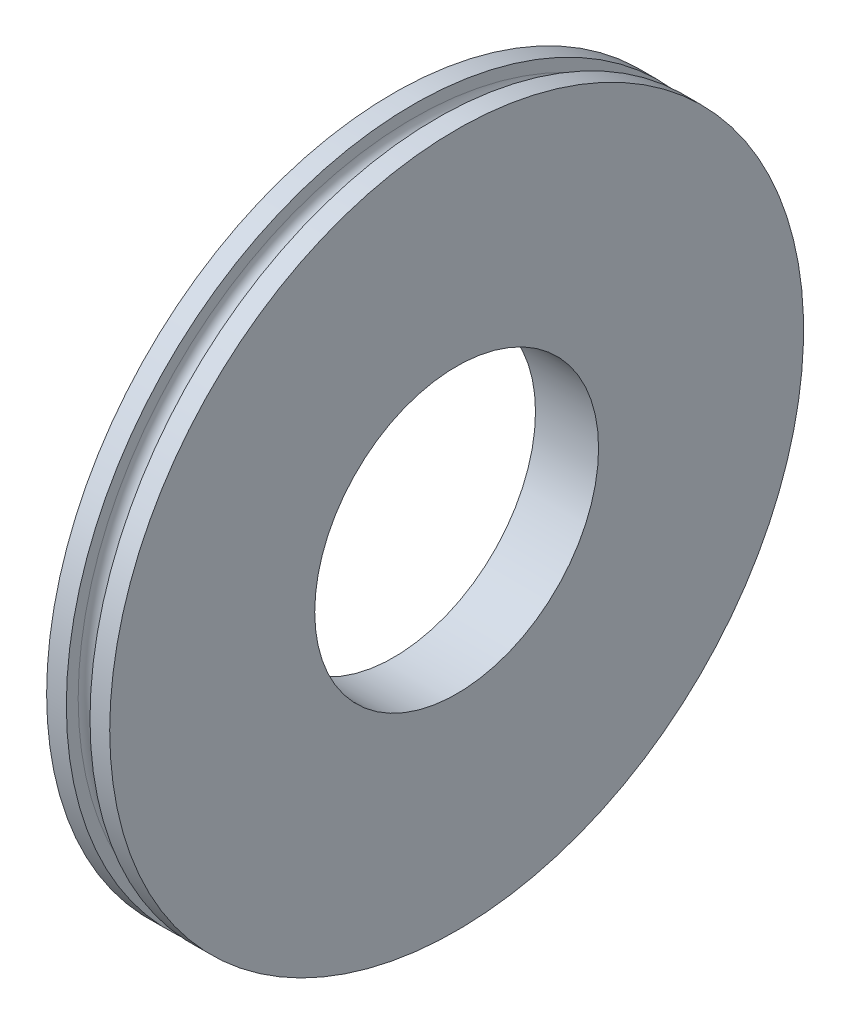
ISO-10303-21;
HEADER;
FILE_DESCRIPTION(('STEP AP214'),'2;1');
FILE_NAME('part.step','',(''),(''),'','','');
FILE_SCHEMA(('AUTOMOTIVE_DESIGN { 1 0 10303 214 1 1 1 1 }'));
ENDSEC;
DATA;
#1=APPLICATION_CONTEXT('core data for automotive mechanical design processes');
#2=APPLICATION_PROTOCOL_DEFINITION('international standard','automotive_design',2000,#1);
#3=PRODUCT_CONTEXT('',#1,'mechanical');
#4=PRODUCT('Part','Part','',(#3));
#5=PRODUCT_RELATED_PRODUCT_CATEGORY('part','',(#4));
#6=PRODUCT_DEFINITION_FORMATION('','',#4);
#7=PRODUCT_DEFINITION_CONTEXT('part definition',#1,'design');
#8=PRODUCT_DEFINITION('design','',#6,#7);
#9=PRODUCT_DEFINITION_SHAPE('','',#8);
#10=(LENGTH_UNIT() NAMED_UNIT(*) SI_UNIT(.MILLI.,.METRE.));
#11=(NAMED_UNIT(*) PLANE_ANGLE_UNIT() SI_UNIT($,.RADIAN.));
#12=(NAMED_UNIT(*) SI_UNIT($,.STERADIAN.) SOLID_ANGLE_UNIT());
#13=UNCERTAINTY_MEASURE_WITH_UNIT(LENGTH_MEASURE(1.E-05),#10,'distance_accuracy_value','');
#14=(GEOMETRIC_REPRESENTATION_CONTEXT(3) GLOBAL_UNCERTAINTY_ASSIGNED_CONTEXT((#13)) GLOBAL_UNIT_ASSIGNED_CONTEXT((#10,
#11,#12)) REPRESENTATION_CONTEXT('',''));
#15=CARTESIAN_POINT('',(0.,0.,0.));
#16=DIRECTION('',(0.,0.,1.));
#17=DIRECTION('',(1.,0.,0.));
#18=AXIS2_PLACEMENT_3D('',#15,#16,#17);
#19=CARTESIAN_POINT('',(-3.175,0.,0.));
#20=DIRECTION('',(-1.,0.,0.));
#21=DIRECTION('',(0.,0.,1.));
#22=AXIS2_PLACEMENT_3D('',#19,#20,#21);
#23=CYLINDRICAL_SURFACE('',#22,34.925);
#24=CARTESIAN_POINT('',(1.190625,0.,0.));
#25=DIRECTION('',(-1.,0.,0.));
#26=DIRECTION('',(0.,0.,1.));
#27=AXIS2_PLACEMENT_3D('',#24,#25,#26);
#28=CIRCLE('',#27,34.925);
#29=CARTESIAN_POINT('',(1.190625,0.,34.925));
#30=VERTEX_POINT('',#29);
#31=EDGE_CURVE('E48',#30,#30,#28,.T.);
#32=ORIENTED_EDGE('',*,*,#31,.F.);
#33=EDGE_LOOP('',(#32));
#34=FACE_BOUND('',#33,.T.);
#35=CARTESIAN_POINT('',(3.175,0.,0.));
#36=DIRECTION('',(-1.,0.,0.));
#37=DIRECTION('',(0.,0.,1.));
#38=AXIS2_PLACEMENT_3D('',#35,#36,#37);
#39=CIRCLE('',#38,34.925);
#40=CARTESIAN_POINT('',(3.175,0.,34.925));
#41=VERTEX_POINT('',#40);
#42=EDGE_CURVE('E12',#41,#41,#39,.T.);
#43=ORIENTED_EDGE('',*,*,#42,.T.);
#44=EDGE_LOOP('',(#43));
#45=FACE_BOUND('',#44,.T.);
#46=ADVANCED_FACE('F42',(#34,#45),#23,.T.);
#47=CARTESIAN_POINT('',(1.190625,33.734375,0.));
#48=DIRECTION('',(1.,0.,0.));
#49=DIRECTION('',(0.,0.,-1.));
#50=AXIS2_PLACEMENT_3D('',#47,#48,#49);
#51=PLANE('',#50);
#52=CARTESIAN_POINT('',(1.190625,0.,0.));
#53=DIRECTION('',(-1.,0.,0.));
#54=DIRECTION('',(0.,0.,1.));
#55=AXIS2_PLACEMENT_3D('',#52,#53,#54);
#56=CIRCLE('',#55,33.734375);
#57=CARTESIAN_POINT('',(1.190625,0.,33.734375));
#58=VERTEX_POINT('',#57);
#59=EDGE_CURVE('E52',#58,#58,#56,.T.);
#60=ORIENTED_EDGE('',*,*,#59,.F.);
#61=EDGE_LOOP('',(#60));
#62=FACE_BOUND('',#61,.T.);
#63=ORIENTED_EDGE('',*,*,#31,.T.);
#64=EDGE_LOOP('',(#63));
#65=FACE_BOUND('',#64,.T.);
#66=ADVANCED_FACE('F93',(#62,#65),#51,.F.);
#67=CARTESIAN_POINT('',(0.,0.,0.));
#68=DIRECTION('',(-1.,0.,0.));
#69=DIRECTION('',(0.,0.,1.));
#70=AXIS2_PLACEMENT_3D('',#67,#68,#69);
#71=TOROIDAL_SURFACE('',#70,33.734375,1.190625);
#72=CARTESIAN_POINT('',(-1.190625,0.,0.));
#73=DIRECTION('',(-1.,0.,0.));
#74=DIRECTION('',(0.,0.,1.));
#75=AXIS2_PLACEMENT_3D('',#72,#73,#74);
#76=CIRCLE('',#75,33.734375);
#77=CARTESIAN_POINT('',(-1.190625,0.,33.734375));
#78=VERTEX_POINT('',#77);
#79=EDGE_CURVE('E56',#78,#78,#76,.T.);
#80=ORIENTED_EDGE('',*,*,#79,.F.);
#81=EDGE_LOOP('',(#80));
#82=FACE_BOUND('',#81,.T.);
#83=ORIENTED_EDGE('',*,*,#59,.T.);
#84=EDGE_LOOP('',(#83));
#85=FACE_BOUND('',#84,.T.);
#86=ADVANCED_FACE('F98',(#82,#85),#71,.F.);
#87=CARTESIAN_POINT('',(-1.190625,33.734375,0.));
#88=DIRECTION('',(-1.,0.,0.));
#89=DIRECTION('',(0.,0.,1.));
#90=AXIS2_PLACEMENT_3D('',#87,#88,#89);
#91=PLANE('',#90);
#92=CARTESIAN_POINT('',(-1.190625,0.,0.));
#93=DIRECTION('',(-1.,0.,0.));
#94=DIRECTION('',(0.,0.,1.));
#95=AXIS2_PLACEMENT_3D('',#92,#93,#94);
#96=CIRCLE('',#95,34.925);
#97=CARTESIAN_POINT('',(-1.190625,0.,34.925));
#98=VERTEX_POINT('',#97);
#99=EDGE_CURVE('E61',#98,#98,#96,.T.);
#100=ORIENTED_EDGE('',*,*,#99,.F.);
#101=EDGE_LOOP('',(#100));
#102=FACE_BOUND('',#101,.T.);
#103=ORIENTED_EDGE('',*,*,#79,.T.);
#104=EDGE_LOOP('',(#103));
#105=FACE_BOUND('',#104,.T.);
#106=ADVANCED_FACE('F103',(#102,#105),#91,.F.);
#107=CARTESIAN_POINT('',(-3.175,0.,0.));
#108=DIRECTION('',(-1.,0.,0.));
#109=DIRECTION('',(0.,0.,1.));
#110=AXIS2_PLACEMENT_3D('',#107,#108,#109);
#111=CYLINDRICAL_SURFACE('',#110,34.925);
#112=CARTESIAN_POINT('',(-3.175,0.,0.));
#113=DIRECTION('',(-1.,0.,0.));
#114=DIRECTION('',(0.,0.,1.));
#115=AXIS2_PLACEMENT_3D('',#112,#113,#114);
#116=CIRCLE('',#115,34.925);
#117=CARTESIAN_POINT('',(-3.175,0.,34.925));
#118=VERTEX_POINT('',#117);
#119=EDGE_CURVE('E64',#118,#118,#116,.T.);
#120=ORIENTED_EDGE('',*,*,#119,.F.);
#121=EDGE_LOOP('',(#120));
#122=FACE_BOUND('',#121,.T.);
#123=ORIENTED_EDGE('',*,*,#99,.T.);
#124=EDGE_LOOP('',(#123));
#125=FACE_BOUND('',#124,.T.);
#126=ADVANCED_FACE('F90',(#122,#125),#111,.T.);
#127=CARTESIAN_POINT('',(-3.175,0.,0.));
#128=DIRECTION('',(1.,0.,0.));
#129=DIRECTION('',(0.,0.,-1.));
#130=AXIS2_PLACEMENT_3D('',#127,#128,#129);
#131=PLANE('',#130);
#132=CARTESIAN_POINT('',(-3.175,0.,0.));
#133=DIRECTION('',(1.,0.,0.));
#134=DIRECTION('',(0.,0.,-1.));
#135=AXIS2_PLACEMENT_3D('',#132,#133,#134);
#136=CIRCLE('',#135,14.2875);
#137=CARTESIAN_POINT('',(-3.175,0.,-14.2875));
#138=VERTEX_POINT('',#137);
#139=EDGE_CURVE('E67',#138,#138,#136,.T.);
#140=ORIENTED_EDGE('',*,*,#139,.T.);
#141=EDGE_LOOP('',(#140));
#142=FACE_BOUND('',#141,.T.);
#143=ORIENTED_EDGE('',*,*,#119,.T.);
#144=EDGE_LOOP('',(#143));
#145=FACE_BOUND('',#144,.T.);
#146=ADVANCED_FACE('F74',(#142,#145),#131,.F.);
#147=CARTESIAN_POINT('',(3.175,0.,0.));
#148=DIRECTION('',(-1.,0.,0.));
#149=DIRECTION('',(0.,0.,1.));
#150=AXIS2_PLACEMENT_3D('',#147,#148,#149);
#151=PLANE('',#150);
#152=CARTESIAN_POINT('',(3.175,0.,0.));
#153=DIRECTION('',(1.,0.,0.));
#154=DIRECTION('',(0.,0.,-1.));
#155=AXIS2_PLACEMENT_3D('',#152,#153,#154);
#156=CIRCLE('',#155,14.2875);
#157=CARTESIAN_POINT('',(3.175,0.,-14.2875));
#158=VERTEX_POINT('',#157);
#159=EDGE_CURVE('E68',#158,#158,#156,.T.);
#160=ORIENTED_EDGE('',*,*,#159,.F.);
#161=EDGE_LOOP('',(#160));
#162=FACE_BOUND('',#161,.T.);
#163=ORIENTED_EDGE('',*,*,#42,.F.);
#164=EDGE_LOOP('',(#163));
#165=FACE_BOUND('',#164,.T.);
#166=ADVANCED_FACE('F80',(#162,#165),#151,.F.);
#167=CARTESIAN_POINT('',(-3.175,0.,0.));
#168=DIRECTION('',(1.,0.,0.));
#169=DIRECTION('',(0.,0.,-1.));
#170=AXIS2_PLACEMENT_3D('',#167,#168,#169);
#171=CYLINDRICAL_SURFACE('',#170,14.2875);
#172=ORIENTED_EDGE('',*,*,#139,.F.);
#173=EDGE_LOOP('',(#172));
#174=FACE_BOUND('',#173,.T.);
#175=ORIENTED_EDGE('',*,*,#159,.T.);
#176=EDGE_LOOP('',(#175));
#177=FACE_BOUND('',#176,.T.);
#178=ADVANCED_FACE('F77',(#174,#177),#171,.F.);
#179=CLOSED_SHELL('',(#46,#66,#86,#106,#126,#146,#166,#178));
#180=MANIFOLD_SOLID_BREP('B2',#179);
#181=ADVANCED_BREP_SHAPE_REPRESENTATION('',(#18,#180),#14);
#182=SHAPE_DEFINITION_REPRESENTATION(#9,#181);
ENDSEC;
END-ISO-10303-21;
